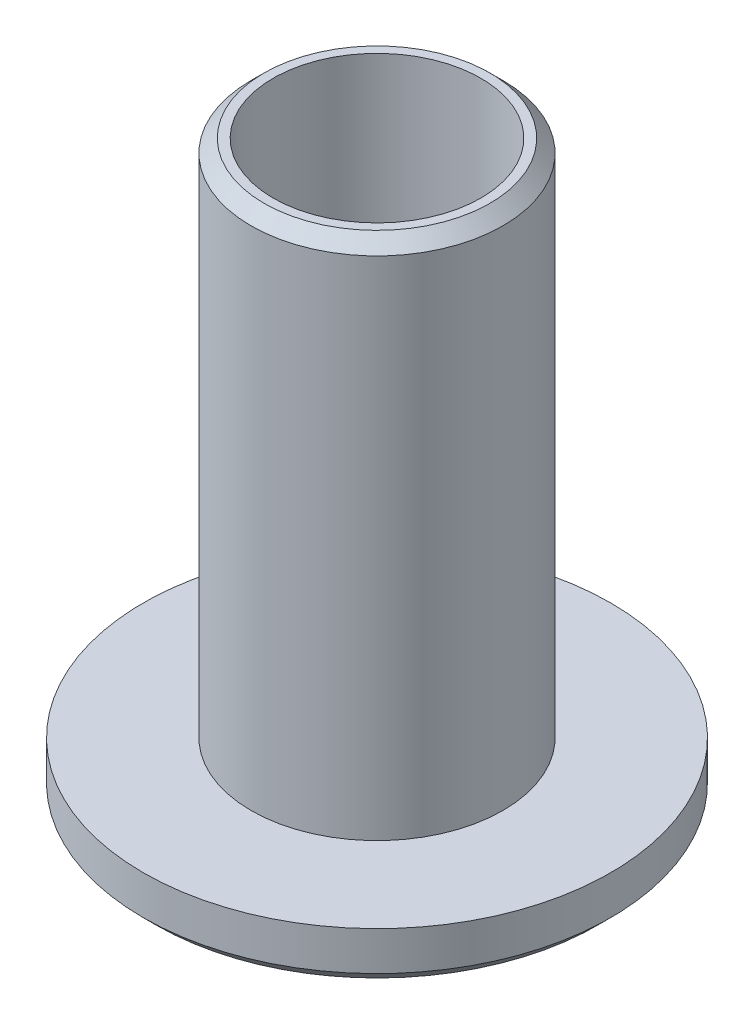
ISO-10303-21;
HEADER;
FILE_DESCRIPTION(('STEP AP214'),'2;1');
FILE_NAME('part.step','',(''),(''),'','','');
FILE_SCHEMA(('AUTOMOTIVE_DESIGN { 1 0 10303 214 1 1 1 1 }'));
ENDSEC;
DATA;
#1=APPLICATION_CONTEXT('core data for automotive mechanical design processes');
#2=APPLICATION_PROTOCOL_DEFINITION('international standard','automotive_design',2000,#1);
#3=PRODUCT_CONTEXT('',#1,'mechanical');
#4=PRODUCT('Part','Part','',(#3));
#5=PRODUCT_RELATED_PRODUCT_CATEGORY('part','',(#4));
#6=PRODUCT_DEFINITION_FORMATION('','',#4);
#7=PRODUCT_DEFINITION_CONTEXT('part definition',#1,'design');
#8=PRODUCT_DEFINITION('design','',#6,#7);
#9=PRODUCT_DEFINITION_SHAPE('','',#8);
#10=(LENGTH_UNIT() NAMED_UNIT(*) SI_UNIT(.MILLI.,.METRE.));
#11=(NAMED_UNIT(*) PLANE_ANGLE_UNIT() SI_UNIT($,.RADIAN.));
#12=(NAMED_UNIT(*) SI_UNIT($,.STERADIAN.) SOLID_ANGLE_UNIT());
#13=UNCERTAINTY_MEASURE_WITH_UNIT(LENGTH_MEASURE(1.E-05),#10,'distance_accuracy_value','');
#14=(GEOMETRIC_REPRESENTATION_CONTEXT(3) GLOBAL_UNCERTAINTY_ASSIGNED_CONTEXT((#13)) GLOBAL_UNIT_ASSIGNED_CONTEXT((#10,
#11,#12)) REPRESENTATION_CONTEXT('',''));
#15=CARTESIAN_POINT('',(0.,0.,0.));
#16=DIRECTION('',(0.,0.,1.));
#17=DIRECTION('',(1.,0.,0.));
#18=AXIS2_PLACEMENT_3D('',#15,#16,#17);
#19=CARTESIAN_POINT('',(0.,2.,0.));
#20=DIRECTION('',(0.,1.,0.));
#21=DIRECTION('',(0.,0.,1.));
#22=AXIS2_PLACEMENT_3D('',#19,#20,#21);
#23=PLANE('',#22);
#24=CARTESIAN_POINT('',(0.,2.,0.));
#25=DIRECTION('',(0.,1.,0.));
#26=DIRECTION('',(0.,0.,1.));
#27=AXIS2_PLACEMENT_3D('',#24,#25,#26);
#28=CIRCLE('',#27,9.);
#29=CARTESIAN_POINT('',(0.,2.,9.));
#30=VERTEX_POINT('',#29);
#31=EDGE_CURVE('E64',#30,#30,#28,.T.);
#32=ORIENTED_EDGE('',*,*,#31,.T.);
#33=EDGE_LOOP('',(#32));
#34=FACE_BOUND('',#33,.T.);
#35=CARTESIAN_POINT('',(0.,2.,0.));
#36=DIRECTION('',(0.,1.,0.));
#37=DIRECTION('',(0.,0.,1.));
#38=AXIS2_PLACEMENT_3D('',#35,#36,#37);
#39=CIRCLE('',#38,4.85);
#40=CARTESIAN_POINT('',(0.,2.,4.85));
#41=VERTEX_POINT('',#40);
#42=EDGE_CURVE('E72',#41,#41,#39,.T.);
#43=ORIENTED_EDGE('',*,*,#42,.F.);
#44=EDGE_LOOP('',(#43));
#45=FACE_BOUND('',#44,.T.);
#46=ADVANCED_FACE('F39',(#34,#45),#23,.T.);
#47=CARTESIAN_POINT('',(0.,0.,0.));
#48=DIRECTION('',(0.,1.,0.));
#49=DIRECTION('',(0.,0.,1.));
#50=AXIS2_PLACEMENT_3D('',#47,#48,#49);
#51=PLANE('',#50);
#52=CARTESIAN_POINT('',(0.,0.,0.));
#53=DIRECTION('',(0.,1.,0.));
#54=DIRECTION('',(0.,0.,1.));
#55=AXIS2_PLACEMENT_3D('',#52,#53,#54);
#56=CIRCLE('',#55,8.5);
#57=CARTESIAN_POINT('',(0.,0.,8.5));
#58=VERTEX_POINT('',#57);
#59=EDGE_CURVE('E53',#58,#58,#56,.F.);
#60=ORIENTED_EDGE('',*,*,#59,.T.);
#61=EDGE_LOOP('',(#60));
#62=FACE_BOUND('',#61,.T.);
#63=CARTESIAN_POINT('',(0.,0.,0.));
#64=DIRECTION('',(0.,1.,0.));
#65=DIRECTION('',(0.,0.,1.));
#66=AXIS2_PLACEMENT_3D('',#63,#64,#65);
#67=CIRCLE('',#66,4.);
#68=CARTESIAN_POINT('',(0.,0.,4.));
#69=VERTEX_POINT('',#68);
#70=EDGE_CURVE('E68',#69,#69,#67,.T.);
#71=ORIENTED_EDGE('',*,*,#70,.T.);
#72=EDGE_LOOP('',(#71));
#73=FACE_BOUND('',#72,.T.);
#74=ADVANCED_FACE('F97',(#62,#73),#51,.F.);
#75=CARTESIAN_POINT('',(0.,2.,0.));
#76=DIRECTION('',(0.,-1.,0.));
#77=DIRECTION('',(0.,0.,-1.));
#78=AXIS2_PLACEMENT_3D('',#75,#76,#77);
#79=CYLINDRICAL_SURFACE('',#78,9.);
#80=CARTESIAN_POINT('',(0.,0.499999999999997,0.));
#81=DIRECTION('',(0.,1.,0.));
#82=DIRECTION('',(0.,0.,1.));
#83=AXIS2_PLACEMENT_3D('',#80,#81,#82);
#84=CIRCLE('',#83,9.);
#85=CARTESIAN_POINT('',(0.,0.499999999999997,9.));
#86=VERTEX_POINT('',#85);
#87=EDGE_CURVE('E58',#86,#86,#84,.T.);
#88=ORIENTED_EDGE('',*,*,#87,.T.);
#89=EDGE_LOOP('',(#88));
#90=FACE_BOUND('',#89,.T.);
#91=ORIENTED_EDGE('',*,*,#31,.F.);
#92=EDGE_LOOP('',(#91));
#93=FACE_BOUND('',#92,.T.);
#94=ADVANCED_FACE('F93',(#90,#93),#79,.T.);
#95=CARTESIAN_POINT('',(0.,2.,0.));
#96=DIRECTION('',(0.,-1.,0.));
#97=DIRECTION('',(0.,0.,-1.));
#98=AXIS2_PLACEMENT_3D('',#95,#96,#97);
#99=CYLINDRICAL_SURFACE('',#98,4.);
#100=ORIENTED_EDGE('',*,*,#70,.F.);
#101=EDGE_LOOP('',(#100));
#102=FACE_BOUND('',#101,.T.);
#103=CARTESIAN_POINT('',(0.,22.,0.));
#104=DIRECTION('',(0.,1.,0.));
#105=DIRECTION('',(0.,0.,1.));
#106=AXIS2_PLACEMENT_3D('',#103,#104,#105);
#107=CIRCLE('',#106,4.);
#108=CARTESIAN_POINT('',(0.,22.,4.));
#109=VERTEX_POINT('',#108);
#110=EDGE_CURVE('E76',#109,#109,#107,.T.);
#111=ORIENTED_EDGE('',*,*,#110,.T.);
#112=EDGE_LOOP('',(#111));
#113=FACE_BOUND('',#112,.T.);
#114=ADVANCED_FACE('F81',(#102,#113),#99,.F.);
#115=CARTESIAN_POINT('',(0.,22.,0.));
#116=DIRECTION('',(0.,1.,0.));
#117=DIRECTION('',(0.,0.,1.));
#118=AXIS2_PLACEMENT_3D('',#115,#116,#117);
#119=PLANE('',#118);
#120=CARTESIAN_POINT('',(0.,22.,0.));
#121=DIRECTION('',(0.,1.,0.));
#122=DIRECTION('',(0.,0.,1.));
#123=AXIS2_PLACEMENT_3D('',#120,#121,#122);
#124=CIRCLE('',#123,4.35);
#125=CARTESIAN_POINT('',(0.,22.,4.35));
#126=VERTEX_POINT('',#125);
#127=EDGE_CURVE('E48',#126,#126,#124,.T.);
#128=ORIENTED_EDGE('',*,*,#127,.T.);
#129=EDGE_LOOP('',(#128));
#130=FACE_BOUND('',#129,.T.);
#131=ORIENTED_EDGE('',*,*,#110,.F.);
#132=EDGE_LOOP('',(#131));
#133=FACE_BOUND('',#132,.T.);
#134=ADVANCED_FACE('F83',(#130,#133),#119,.T.);
#135=CARTESIAN_POINT('',(0.,22.,0.));
#136=DIRECTION('',(0.,-1.,0.));
#137=DIRECTION('',(0.,0.,-1.));
#138=AXIS2_PLACEMENT_3D('',#135,#136,#137);
#139=CYLINDRICAL_SURFACE('',#138,4.85);
#140=CARTESIAN_POINT('',(0.,21.5,0.));
#141=DIRECTION('',(0.,1.,0.));
#142=DIRECTION('',(0.,0.,1.));
#143=AXIS2_PLACEMENT_3D('',#140,#141,#142);
#144=CIRCLE('',#143,4.85);
#145=CARTESIAN_POINT('',(0.,21.5,4.85));
#146=VERTEX_POINT('',#145);
#147=EDGE_CURVE('E10',#146,#146,#144,.F.);
#148=ORIENTED_EDGE('',*,*,#147,.T.);
#149=EDGE_LOOP('',(#148));
#150=FACE_BOUND('',#149,.T.);
#151=ORIENTED_EDGE('',*,*,#42,.T.);
#152=EDGE_LOOP('',(#151));
#153=FACE_BOUND('',#152,.T.);
#154=ADVANCED_FACE('F85',(#150,#153),#139,.T.);
#155=CARTESIAN_POINT('',(0.,0.499999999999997,0.));
#156=DIRECTION('',(0.,1.,0.));
#157=DIRECTION('',(0.,0.,1.));
#158=AXIS2_PLACEMENT_3D('',#155,#156,#157);
#159=CONICAL_SURFACE('',#158,9.,0.785398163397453);
#160=ORIENTED_EDGE('',*,*,#59,.F.);
#161=EDGE_LOOP('',(#160));
#162=FACE_BOUND('',#161,.T.);
#163=ORIENTED_EDGE('',*,*,#87,.F.);
#164=EDGE_LOOP('',(#163));
#165=FACE_BOUND('',#164,.T.);
#166=ADVANCED_FACE('F91',(#162,#165),#159,.T.);
#167=CARTESIAN_POINT('',(0.,22.,0.));
#168=DIRECTION('',(0.,-1.,0.));
#169=DIRECTION('',(0.,0.,-1.));
#170=AXIS2_PLACEMENT_3D('',#167,#168,#169);
#171=CONICAL_SURFACE('',#170,4.35,0.785398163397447);
#172=ORIENTED_EDGE('',*,*,#147,.F.);
#173=EDGE_LOOP('',(#172));
#174=FACE_BOUND('',#173,.T.);
#175=ORIENTED_EDGE('',*,*,#127,.F.);
#176=EDGE_LOOP('',(#175));
#177=FACE_BOUND('',#176,.T.);
#178=ADVANCED_FACE('F42',(#174,#177),#171,.T.);
#179=CLOSED_SHELL('',(#46,#74,#94,#114,#134,#154,#166,#178));
#180=MANIFOLD_SOLID_BREP('B2',#179);
#181=ADVANCED_BREP_SHAPE_REPRESENTATION('',(#18,#180),#14);
#182=SHAPE_DEFINITION_REPRESENTATION(#9,#181);
ENDSEC;
END-ISO-10303-21;
